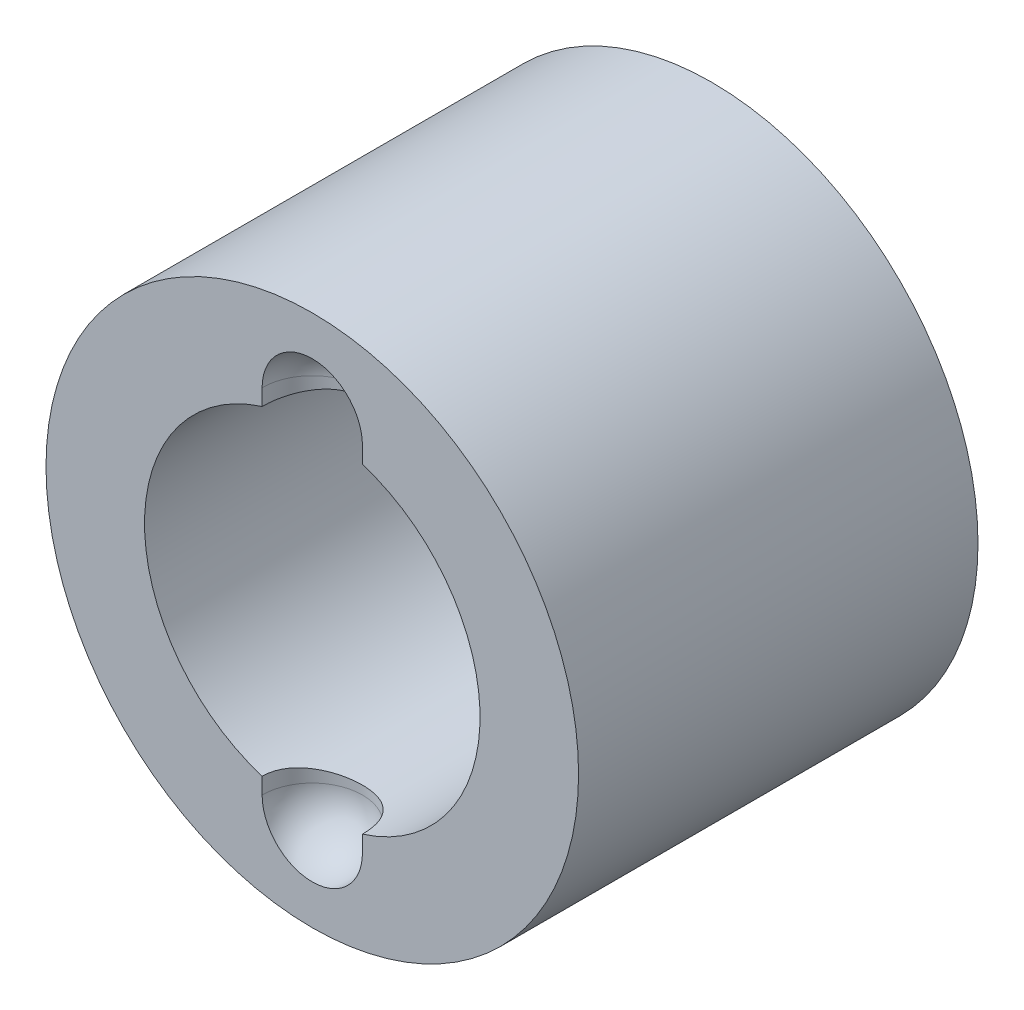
ISO-10303-21;
HEADER;
FILE_DESCRIPTION(('STEP AP214'),'2;1');
FILE_NAME('part.step','',(''),(''),'','','');
FILE_SCHEMA(('AUTOMOTIVE_DESIGN { 1 0 10303 214 1 1 1 1 }'));
ENDSEC;
DATA;
#1=APPLICATION_CONTEXT('core data for automotive mechanical design processes');
#2=APPLICATION_PROTOCOL_DEFINITION('international standard','automotive_design',2000,#1);
#3=PRODUCT_CONTEXT('',#1,'mechanical');
#4=PRODUCT('Part','Part','',(#3));
#5=PRODUCT_RELATED_PRODUCT_CATEGORY('part','',(#4));
#6=PRODUCT_DEFINITION_FORMATION('','',#4);
#7=PRODUCT_DEFINITION_CONTEXT('part definition',#1,'design');
#8=PRODUCT_DEFINITION('design','',#6,#7);
#9=PRODUCT_DEFINITION_SHAPE('','',#8);
#10=(LENGTH_UNIT() NAMED_UNIT(*) SI_UNIT(.MILLI.,.METRE.));
#11=(NAMED_UNIT(*) PLANE_ANGLE_UNIT() SI_UNIT($,.RADIAN.));
#12=(NAMED_UNIT(*) SI_UNIT($,.STERADIAN.) SOLID_ANGLE_UNIT());
#13=UNCERTAINTY_MEASURE_WITH_UNIT(LENGTH_MEASURE(1.E-05),#10,'distance_accuracy_value','');
#14=(GEOMETRIC_REPRESENTATION_CONTEXT(3) GLOBAL_UNCERTAINTY_ASSIGNED_CONTEXT((#13)) GLOBAL_UNIT_ASSIGNED_CONTEXT((#10,
#11,#12)) REPRESENTATION_CONTEXT('',''));
#15=CARTESIAN_POINT('',(0.,0.,0.));
#16=DIRECTION('',(0.,0.,1.));
#17=DIRECTION('',(1.,0.,0.));
#18=AXIS2_PLACEMENT_3D('',#15,#16,#17);
#19=CARTESIAN_POINT('',(0.,0.,19.05));
#20=DIRECTION('',(0.,0.,1.));
#21=DIRECTION('',(1.,0.,0.));
#22=AXIS2_PLACEMENT_3D('',#19,#20,#21);
#23=PLANE('',#22);
#24=CARTESIAN_POINT('',(0.,0.,19.05));
#25=DIRECTION('',(0.,0.,1.));
#26=DIRECTION('',(1.,0.,0.));
#27=AXIS2_PLACEMENT_3D('',#24,#25,#26);
#28=CIRCLE('',#27,12.7);
#29=CARTESIAN_POINT('',(-12.7,0.,19.05));
#30=VERTEX_POINT('',#29);
#31=EDGE_CURVE('E117',#30,#30,#28,.T.);
#32=ORIENTED_EDGE('',*,*,#31,.T.);
#33=EDGE_LOOP('',(#32));
#34=FACE_BOUND('',#33,.T.);
#35=CARTESIAN_POINT('',(0.,0.,19.05));
#36=DIRECTION('',(0.,0.,1.));
#37=DIRECTION('',(1.,0.,0.));
#38=AXIS2_PLACEMENT_3D('',#35,#36,#37);
#39=CIRCLE('',#38,8.001);
#40=CARTESIAN_POINT('',(-2.39273154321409,7.63484359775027,19.05));
#41=VERTEX_POINT('',#40);
#42=CARTESIAN_POINT('',(-2.39273154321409,-7.63484359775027,19.0500000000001));
#43=VERTEX_POINT('',#42);
#44=EDGE_CURVE('E113',#41,#43,#39,.T.);
#45=ORIENTED_EDGE('',*,*,#44,.F.);
#46=DIRECTION('',(0.,-1.,0.));
#47=VECTOR('',#46,1.);
#48=CARTESIAN_POINT('',(-2.39273154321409,8.41205481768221,19.0500000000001));
#49=LINE('',#48,#47);
#50=CARTESIAN_POINT('',(-2.39273154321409,8.41205481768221,19.0500000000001));
#51=VERTEX_POINT('',#50);
#52=EDGE_CURVE('E57',#51,#41,#49,.T.);
#53=ORIENTED_EDGE('',*,*,#52,.F.);
#54=CARTESIAN_POINT('',(0.000592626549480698,8.41205481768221,19.05));
#55=DIRECTION('',(0.,0.,1.));
#56=DIRECTION('',(1.,0.,0.));
#57=AXIS2_PLACEMENT_3D('',#54,#55,#56);
#58=CIRCLE('',#57,2.39332416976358);
#59=CARTESIAN_POINT('',(0.,10.8053789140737,19.05));
#60=VERTEX_POINT('',#59);
#61=EDGE_CURVE('E85',#60,#51,#58,.T.);
#62=ORIENTED_EDGE('',*,*,#61,.F.);
#63=CARTESIAN_POINT('',(-0.000592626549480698,8.41205481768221,19.05));
#64=DIRECTION('',(0.,0.,-1.));
#65=DIRECTION('',(-1.,0.,0.));
#66=AXIS2_PLACEMENT_3D('',#63,#64,#65);
#67=CIRCLE('',#66,2.39332416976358);
#68=CARTESIAN_POINT('',(2.39273154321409,8.41205481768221,19.05));
#69=VERTEX_POINT('',#68);
#70=EDGE_CURVE('E83',#60,#69,#67,.T.);
#71=ORIENTED_EDGE('',*,*,#70,.T.);
#72=DIRECTION('',(0.,-1.,0.));
#73=VECTOR('',#72,1.);
#74=CARTESIAN_POINT('',(2.39273154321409,8.41205481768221,19.05));
#75=LINE('',#74,#73);
#76=CARTESIAN_POINT('',(2.39273154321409,7.63484359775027,19.0499999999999));
#77=VERTEX_POINT('',#76);
#78=EDGE_CURVE('E90',#69,#77,#75,.T.);
#79=ORIENTED_EDGE('',*,*,#78,.T.);
#80=CARTESIAN_POINT('',(2.39273154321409,-7.63484359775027,19.05));
#81=VERTEX_POINT('',#80);
#82=EDGE_CURVE('E111',#81,#77,#39,.T.);
#83=ORIENTED_EDGE('',*,*,#82,.F.);
#84=CARTESIAN_POINT('',(2.39273154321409,-8.41205481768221,19.05));
#85=VERTEX_POINT('',#84);
#86=EDGE_CURVE('E49',#81,#85,#75,.T.);
#87=ORIENTED_EDGE('',*,*,#86,.T.);
#88=CARTESIAN_POINT('',(-0.000592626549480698,-8.41205481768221,19.05));
#89=DIRECTION('',(0.,0.,1.));
#90=DIRECTION('',(1.,0.,0.));
#91=AXIS2_PLACEMENT_3D('',#88,#89,#90);
#92=CIRCLE('',#91,2.39332416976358);
#93=CARTESIAN_POINT('',(0.,-10.8053789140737,19.05));
#94=VERTEX_POINT('',#93);
#95=EDGE_CURVE('E95',#94,#85,#92,.T.);
#96=ORIENTED_EDGE('',*,*,#95,.F.);
#97=CARTESIAN_POINT('',(0.000592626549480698,-8.41205481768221,19.05));
#98=DIRECTION('',(0.,0.,-1.));
#99=DIRECTION('',(-1.,0.,0.));
#100=AXIS2_PLACEMENT_3D('',#97,#98,#99);
#101=CIRCLE('',#100,2.39332416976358);
#102=CARTESIAN_POINT('',(-2.39273154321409,-8.41205481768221,19.0500000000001));
#103=VERTEX_POINT('',#102);
#104=EDGE_CURVE('E105',#94,#103,#101,.T.);
#105=ORIENTED_EDGE('',*,*,#104,.T.);
#106=EDGE_CURVE('E103',#43,#103,#49,.T.);
#107=ORIENTED_EDGE('',*,*,#106,.F.);
#108=EDGE_LOOP('',(#45,#53,#62,#71,#79,#83,#87,#96,#105,#107));
#109=FACE_BOUND('',#108,.T.);
#110=ADVANCED_FACE('F29',(#34,#109),#23,.T.);
#111=CARTESIAN_POINT('',(0.,0.,19.05));
#112=DIRECTION('',(0.,0.,-1.));
#113=DIRECTION('',(-1.,0.,0.));
#114=AXIS2_PLACEMENT_3D('',#111,#112,#113);
#115=CYLINDRICAL_SURFACE('',#114,8.001);
#116=CARTESIAN_POINT('',(0.,0.,0.));
#117=DIRECTION('',(0.,0.,1.));
#118=DIRECTION('',(1.,0.,0.));
#119=AXIS2_PLACEMENT_3D('',#116,#117,#118);
#120=CIRCLE('',#119,8.001);
#121=CARTESIAN_POINT('',(8.001,0.,0.));
#122=VERTEX_POINT('',#121);
#123=EDGE_CURVE('E86',#122,#122,#120,.T.);
#124=ORIENTED_EDGE('',*,*,#123,.F.);
#125=EDGE_LOOP('',(#124));
#126=FACE_BOUND('',#125,.T.);
#127=ORIENTED_EDGE('',*,*,#82,.T.);
#128=CARTESIAN_POINT('',(2.39273154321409,7.63484359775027,19.05));
#129=CARTESIAN_POINT('',(2.39273973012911,7.6348344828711,18.9843206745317));
#130=CARTESIAN_POINT('',(2.3900273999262,7.63569090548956,18.9186465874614));
#131=CARTESIAN_POINT('',(2.37922539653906,7.63906708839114,18.7877994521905));
#132=CARTESIAN_POINT('',(2.37113692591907,7.6415864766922,18.7226262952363));
#133=CARTESIAN_POINT('',(2.3496733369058,7.64821255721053,18.593404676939));
#134=CARTESIAN_POINT('',(2.33631158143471,7.65231523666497,18.5293537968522));
#135=CARTESIAN_POINT('',(2.30443249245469,7.66197542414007,18.4026772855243));
#136=CARTESIAN_POINT('',(2.28591502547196,7.66753296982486,18.3400516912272));
#137=CARTESIAN_POINT('',(2.22285582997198,7.68614716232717,18.1550052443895));
#138=CARTESIAN_POINT('',(2.17077984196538,7.70115438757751,18.0352511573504));
#139=CARTESIAN_POINT('',(2.04816829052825,7.73466371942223,17.8061799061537));
#140=CARTESIAN_POINT('',(1.97762421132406,7.75316743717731,17.6968675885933));
#141=CARTESIAN_POINT('',(1.81770565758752,7.79223315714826,17.4883183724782));
#142=CARTESIAN_POINT('',(1.72785466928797,7.81283859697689,17.3894542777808));
#143=CARTESIAN_POINT('',(1.53289349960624,7.8534157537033,17.2079497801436));
#144=CARTESIAN_POINT('',(1.42778074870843,7.87338736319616,17.1253121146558));
#145=CARTESIAN_POINT('',(1.20261061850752,7.91094188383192,16.976975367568));
#146=CARTESIAN_POINT('',(1.08229064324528,7.92846731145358,16.9116590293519));
#147=CARTESIAN_POINT('',(0.8317667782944,7.95864659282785,16.8023358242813));
#148=CARTESIAN_POINT('',(0.701565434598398,7.97130169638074,16.7583234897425));
#149=CARTESIAN_POINT('',(0.438898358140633,7.99000655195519,16.6940949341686));
#150=CARTESIAN_POINT('',(0.306602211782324,7.99623384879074,16.6732378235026));
#151=CARTESIAN_POINT('',(0.0402488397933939,8.00200662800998,16.6538855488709));
#152=CARTESIAN_POINT('',(-0.0938080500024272,8.00155336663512,16.6553861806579));
#153=CARTESIAN_POINT('',(-0.355377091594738,7.99414146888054,16.6802768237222));
#154=CARTESIAN_POINT('',(-0.482962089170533,7.98738920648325,16.7029724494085));
#155=CARTESIAN_POINT('',(-0.73242044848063,7.96838872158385,16.7684746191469));
#156=CARTESIAN_POINT('',(-0.85429351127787,7.95614021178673,16.8112822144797));
#157=CARTESIAN_POINT('',(-1.09052538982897,7.92723744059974,16.9162655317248));
#158=CARTESIAN_POINT('',(-1.20478050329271,7.91053366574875,16.978660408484));
#159=CARTESIAN_POINT('',(-1.4214197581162,7.8744932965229,17.1208734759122));
#160=CARTESIAN_POINT('',(-1.52380124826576,7.85515611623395,17.2006955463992));
#161=CARTESIAN_POINT('',(-1.7179231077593,7.81504623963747,17.3790907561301));
#162=CARTESIAN_POINT('',(-1.80910716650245,7.7942469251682,17.478263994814));
#163=CARTESIAN_POINT('',(-1.97372470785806,7.75419952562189,17.690722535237));
#164=CARTESIAN_POINT('',(-2.04715302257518,7.73495189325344,17.8040119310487));
#165=CARTESIAN_POINT('',(-2.17475949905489,7.70005570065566,18.0429648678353));
#166=CARTESIAN_POINT('',(-2.22873802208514,7.68444501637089,18.1687407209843));
#167=CARTESIAN_POINT('',(-2.31451883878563,7.65904940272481,18.4281045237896));
#168=CARTESIAN_POINT('',(-2.3463550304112,7.64925557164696,18.5616801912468));
#169=CARTESIAN_POINT('',(-2.37526724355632,7.64029910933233,18.7554187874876));
#170=CARTESIAN_POINT('',(-2.38181561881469,7.63825778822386,18.8141686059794));
#171=CARTESIAN_POINT('',(-2.39054384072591,7.63552986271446,18.9319356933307));
#172=CARTESIAN_POINT('',(-2.39273012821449,7.6348412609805,18.9909524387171));
#173=CARTESIAN_POINT('',(-2.39273154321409,7.63484359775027,19.05));
#174=B_SPLINE_CURVE_WITH_KNOTS('',3,(#128,#129,#130,#131,#132,#133,#134,#135,#136,#137,#138,
#139,#140,#141,#142,#143,#144,#145,#146,#147,#148,#149,#150,#151,#152,#153,#154,#155,#156,#157,
#158,#159,#160,#161,#162,#163,#164,#165,#166,#167,#168,#169,#170,#171,#172,#173),.UNSPECIFIED.,
.F.,.F.,(4,2,2,2,2,2,2,2,2,2,2,2,2,2,2,2,2,2,2,2,2,2,4),(0.,0.196967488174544,0.393890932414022,
0.590318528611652,0.78675121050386,1.17912452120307,1.57167907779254,1.97534588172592,
2.37908072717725,2.79110750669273,3.20302848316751,3.60323971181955,4.00337568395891,
4.39084583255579,4.77833623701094,5.17032669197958,5.56240450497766,5.96946862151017,
6.37665107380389,6.7879013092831,7.19852056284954,7.37581988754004,7.5528572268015),.UNSPECIFIED.);
#175=EDGE_CURVE('E11',#77,#41,#174,.T.);
#176=ORIENTED_EDGE('',*,*,#175,.T.);
#177=ORIENTED_EDGE('',*,*,#44,.T.);
#178=CARTESIAN_POINT('',(-2.39273154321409,-7.63484359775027,19.05));
#179=CARTESIAN_POINT('',(-2.39273973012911,-7.6348344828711,18.9843206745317));
#180=CARTESIAN_POINT('',(-2.3900273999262,-7.63569090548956,18.9186465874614));
#181=CARTESIAN_POINT('',(-2.37922539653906,-7.63906708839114,18.7877994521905));
#182=CARTESIAN_POINT('',(-2.37113692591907,-7.6415864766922,18.7226262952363));
#183=CARTESIAN_POINT('',(-2.3496733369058,-7.64821255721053,18.593404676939));
#184=CARTESIAN_POINT('',(-2.33631158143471,-7.65231523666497,18.5293537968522));
#185=CARTESIAN_POINT('',(-2.30443249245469,-7.66197542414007,18.4026772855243));
#186=CARTESIAN_POINT('',(-2.28591502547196,-7.66753296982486,18.3400516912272));
#187=CARTESIAN_POINT('',(-2.22285582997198,-7.68614716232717,18.1550052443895));
#188=CARTESIAN_POINT('',(-2.17077984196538,-7.70115438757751,18.0352511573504));
#189=CARTESIAN_POINT('',(-2.04816829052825,-7.73466371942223,17.8061799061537));
#190=CARTESIAN_POINT('',(-1.97762421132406,-7.75316743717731,17.6968675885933));
#191=CARTESIAN_POINT('',(-1.81770565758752,-7.79223315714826,17.4883183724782));
#192=CARTESIAN_POINT('',(-1.72785466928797,-7.81283859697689,17.3894542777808));
#193=CARTESIAN_POINT('',(-1.53289349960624,-7.8534157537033,17.2079497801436));
#194=CARTESIAN_POINT('',(-1.42778074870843,-7.87338736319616,17.1253121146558));
#195=CARTESIAN_POINT('',(-1.20261061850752,-7.91094188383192,16.976975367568));
#196=CARTESIAN_POINT('',(-1.08229064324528,-7.92846731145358,16.9116590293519));
#197=CARTESIAN_POINT('',(-0.8317667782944,-7.95864659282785,16.8023358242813));
#198=CARTESIAN_POINT('',(-0.701565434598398,-7.97130169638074,16.7583234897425));
#199=CARTESIAN_POINT('',(-0.438898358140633,-7.99000655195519,16.6940949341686));
#200=CARTESIAN_POINT('',(-0.306602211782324,-7.99623384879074,16.6732378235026));
#201=CARTESIAN_POINT('',(-0.0402488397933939,-8.00200662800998,16.6538855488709));
#202=CARTESIAN_POINT('',(0.0938080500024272,-8.00155336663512,16.6553861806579));
#203=CARTESIAN_POINT('',(0.355377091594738,-7.99414146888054,16.6802768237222));
#204=CARTESIAN_POINT('',(0.482962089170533,-7.98738920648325,16.7029724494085));
#205=CARTESIAN_POINT('',(0.73242044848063,-7.96838872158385,16.7684746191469));
#206=CARTESIAN_POINT('',(0.85429351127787,-7.95614021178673,16.8112822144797));
#207=CARTESIAN_POINT('',(1.09052538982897,-7.92723744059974,16.9162655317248));
#208=CARTESIAN_POINT('',(1.20478050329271,-7.91053366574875,16.978660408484));
#209=CARTESIAN_POINT('',(1.4214197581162,-7.8744932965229,17.1208734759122));
#210=CARTESIAN_POINT('',(1.52380124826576,-7.85515611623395,17.2006955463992));
#211=CARTESIAN_POINT('',(1.7179231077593,-7.81504623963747,17.3790907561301));
#212=CARTESIAN_POINT('',(1.80910716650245,-7.7942469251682,17.478263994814));
#213=CARTESIAN_POINT('',(1.97372470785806,-7.75419952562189,17.690722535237));
#214=CARTESIAN_POINT('',(2.04715302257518,-7.73495189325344,17.8040119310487));
#215=CARTESIAN_POINT('',(2.17475949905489,-7.70005570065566,18.0429648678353));
#216=CARTESIAN_POINT('',(2.22873802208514,-7.68444501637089,18.1687407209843));
#217=CARTESIAN_POINT('',(2.31451883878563,-7.65904940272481,18.4281045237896));
#218=CARTESIAN_POINT('',(2.3463550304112,-7.64925557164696,18.5616801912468));
#219=CARTESIAN_POINT('',(2.37526724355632,-7.64029910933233,18.7554187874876));
#220=CARTESIAN_POINT('',(2.38181561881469,-7.63825778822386,18.8141686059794));
#221=CARTESIAN_POINT('',(2.39054384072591,-7.63552986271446,18.9319356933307));
#222=CARTESIAN_POINT('',(2.39273012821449,-7.6348412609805,18.9909524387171));
#223=CARTESIAN_POINT('',(2.39273154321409,-7.63484359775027,19.05));
#224=B_SPLINE_CURVE_WITH_KNOTS('',3,(#178,#179,#180,#181,#182,#183,#184,#185,#186,#187,#188,
#189,#190,#191,#192,#193,#194,#195,#196,#197,#198,#199,#200,#201,#202,#203,#204,#205,#206,#207,
#208,#209,#210,#211,#212,#213,#214,#215,#216,#217,#218,#219,#220,#221,#222,#223),.UNSPECIFIED.,
.F.,.F.,(4,2,2,2,2,2,2,2,2,2,2,2,2,2,2,2,2,2,2,2,2,2,4),(0.,0.196967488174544,0.393890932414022,
0.590318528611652,0.78675121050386,1.17912452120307,1.57167907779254,1.97534588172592,
2.37908072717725,2.79110750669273,3.20302848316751,3.60323971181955,4.00337568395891,
4.39084583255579,4.77833623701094,5.17032669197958,5.56240450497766,5.96946862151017,
6.37665107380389,6.7879013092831,7.19852056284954,7.37581988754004,7.5528572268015),.UNSPECIFIED.);
#225=EDGE_CURVE('E42',#43,#81,#224,.T.);
#226=ORIENTED_EDGE('',*,*,#225,.T.);
#227=EDGE_LOOP('',(#127,#176,#177,#226));
#228=FACE_BOUND('',#227,.T.);
#229=ADVANCED_FACE('F122',(#126,#228),#115,.F.);
#230=CARTESIAN_POINT('',(0.,0.,0.));
#231=DIRECTION('',(0.,0.,1.));
#232=DIRECTION('',(1.,0.,0.));
#233=AXIS2_PLACEMENT_3D('',#230,#231,#232);
#234=PLANE('',#233);
#235=CARTESIAN_POINT('',(0.,0.,0.));
#236=DIRECTION('',(0.,0.,1.));
#237=DIRECTION('',(1.,0.,0.));
#238=AXIS2_PLACEMENT_3D('',#235,#236,#237);
#239=CIRCLE('',#238,12.7);
#240=CARTESIAN_POINT('',(-12.7,0.,0.));
#241=VERTEX_POINT('',#240);
#242=EDGE_CURVE('E114',#241,#241,#239,.T.);
#243=ORIENTED_EDGE('',*,*,#242,.F.);
#244=EDGE_LOOP('',(#243));
#245=FACE_BOUND('',#244,.T.);
#246=ORIENTED_EDGE('',*,*,#123,.T.);
#247=EDGE_LOOP('',(#246));
#248=FACE_BOUND('',#247,.T.);
#249=ADVANCED_FACE('F143',(#245,#248),#234,.F.);
#250=CARTESIAN_POINT('',(0.,0.,19.05));
#251=DIRECTION('',(0.,0.,-1.));
#252=DIRECTION('',(-1.,0.,0.));
#253=AXIS2_PLACEMENT_3D('',#250,#251,#252);
#254=CYLINDRICAL_SURFACE('',#253,12.7);
#255=CARTESIAN_POINT('',(-12.7,0.,19.05));
#256=CARTESIAN_POINT('',(-12.7,0.,18.8515625));
#257=CARTESIAN_POINT('',(-12.7,0.,18.653125));
#258=CARTESIAN_POINT('',(-12.7,0.,18.25625));
#259=CARTESIAN_POINT('',(-12.7,0.,18.0578125));
#260=CARTESIAN_POINT('',(-12.7,0.,17.6609375));
#261=CARTESIAN_POINT('',(-12.7,0.,17.4625));
#262=CARTESIAN_POINT('',(-12.7,0.,17.065625));
#263=CARTESIAN_POINT('',(-12.7,0.,16.8671875));
#264=CARTESIAN_POINT('',(-12.7,0.,16.4703125));
#265=CARTESIAN_POINT('',(-12.7,0.,16.271875));
#266=CARTESIAN_POINT('',(-12.7,0.,15.875));
#267=CARTESIAN_POINT('',(-12.7,0.,15.6765625));
#268=CARTESIAN_POINT('',(-12.7,0.,15.2796875));
#269=CARTESIAN_POINT('',(-12.7,0.,15.08125));
#270=CARTESIAN_POINT('',(-12.7,0.,14.684375));
#271=CARTESIAN_POINT('',(-12.7,0.,14.4859375));
#272=CARTESIAN_POINT('',(-12.7,0.,14.0890625));
#273=CARTESIAN_POINT('',(-12.7,0.,13.890625));
#274=CARTESIAN_POINT('',(-12.7,0.,13.49375));
#275=CARTESIAN_POINT('',(-12.7,0.,13.2953125));
#276=CARTESIAN_POINT('',(-12.7,0.,12.8984375));
#277=CARTESIAN_POINT('',(-12.7,0.,12.7));
#278=CARTESIAN_POINT('',(-12.7,0.,12.303125));
#279=CARTESIAN_POINT('',(-12.7,0.,12.1046875));
#280=CARTESIAN_POINT('',(-12.7,0.,11.7078125));
#281=CARTESIAN_POINT('',(-12.7,0.,11.509375));
#282=CARTESIAN_POINT('',(-12.7,0.,11.1125));
#283=CARTESIAN_POINT('',(-12.7,0.,10.9140625));
#284=CARTESIAN_POINT('',(-12.7,0.,10.5171875));
#285=CARTESIAN_POINT('',(-12.7,0.,10.31875));
#286=CARTESIAN_POINT('',(-12.7,0.,9.921875));
#287=CARTESIAN_POINT('',(-12.7,0.,9.7234375));
#288=CARTESIAN_POINT('',(-12.7,0.,9.3265625));
#289=CARTESIAN_POINT('',(-12.7,0.,9.128125));
#290=CARTESIAN_POINT('',(-12.7,0.,8.73125));
#291=CARTESIAN_POINT('',(-12.7,0.,8.5328125));
#292=CARTESIAN_POINT('',(-12.7,0.,8.1359375));
#293=CARTESIAN_POINT('',(-12.7,0.,7.9375));
#294=CARTESIAN_POINT('',(-12.7,0.,7.540625));
#295=CARTESIAN_POINT('',(-12.7,0.,7.3421875));
#296=CARTESIAN_POINT('',(-12.7,0.,6.9453125));
#297=CARTESIAN_POINT('',(-12.7,0.,6.746875));
#298=CARTESIAN_POINT('',(-12.7,0.,6.35));
#299=CARTESIAN_POINT('',(-12.7,0.,6.1515625));
#300=CARTESIAN_POINT('',(-12.7,0.,5.7546875));
#301=CARTESIAN_POINT('',(-12.7,0.,5.55625));
#302=CARTESIAN_POINT('',(-12.7,0.,5.159375));
#303=CARTESIAN_POINT('',(-12.7,0.,4.9609375));
#304=CARTESIAN_POINT('',(-12.7,0.,4.5640625));
#305=CARTESIAN_POINT('',(-12.7,0.,4.365625));
#306=CARTESIAN_POINT('',(-12.7,0.,3.96875));
#307=CARTESIAN_POINT('',(-12.7,0.,3.7703125));
#308=CARTESIAN_POINT('',(-12.7,0.,3.3734375));
#309=CARTESIAN_POINT('',(-12.7,0.,3.175));
#310=CARTESIAN_POINT('',(-12.7,0.,2.778125));
#311=CARTESIAN_POINT('',(-12.7,0.,2.5796875));
#312=CARTESIAN_POINT('',(-12.7,0.,2.1828125));
#313=CARTESIAN_POINT('',(-12.7,0.,1.984375));
#314=CARTESIAN_POINT('',(-12.7,0.,1.5875));
#315=CARTESIAN_POINT('',(-12.7,0.,1.3890625));
#316=CARTESIAN_POINT('',(-12.7,0.,0.992187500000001));
#317=CARTESIAN_POINT('',(-12.7,0.,0.793750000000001));
#318=CARTESIAN_POINT('',(-12.7,0.,0.396875));
#319=CARTESIAN_POINT('',(-12.7,0.,0.1984375));
#320=CARTESIAN_POINT('',(-12.7,0.,0.));
#321=B_SPLINE_CURVE_WITH_KNOTS('',3,(#255,#256,#257,#258,#259,#260,#261,#262,#263,#264,#265,
#266,#267,#268,#269,#270,#271,#272,#273,#274,#275,#276,#277,#278,#279,#280,#281,#282,#283,#284,
#285,#286,#287,#288,#289,#290,#291,#292,#293,#294,#295,#296,#297,#298,#299,#300,#301,#302,#303,
#304,#305,#306,#307,#308,#309,#310,#311,#312,#313,#314,#315,#316,#317,#318,#319,#320),
.UNSPECIFIED.,.F.,.F.,(4,2,2,2,2,2,2,2,2,2,2,2,2,2,2,2,2,2,2,2,2,2,2,2,2,2,2,2,2,2,2,2,4),(0.,
0.595312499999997,1.190625,1.7859375,2.38125,2.9765625,3.571875,4.1671875,4.7625,5.3578125,
5.953125,6.5484375,7.14375,7.7390625,8.334375,8.9296875,9.525,10.1203125,10.715625,11.3109375,
11.90625,12.5015625,13.096875,13.6921875,14.2875,14.8828125,15.478125,16.0734375,16.66875,
17.2640625,17.859375,18.4546875,19.05),.UNSPECIFIED.);
#322=EDGE_CURVE('BSEAM31',#30,#241,#321,.T.);
#323=ORIENTED_EDGE('',*,*,#31,.F.);
#324=ORIENTED_EDGE('',*,*,#242,.T.);
#325=ORIENTED_EDGE('',*,*,#322,.T.);
#326=ORIENTED_EDGE('',*,*,#322,.F.);
#327=EDGE_LOOP('',(#323,#325,#324,#326));
#328=FACE_BOUND('',#327,.T.);
#329=ADVANCED_FACE('F31',(#328),#254,.T.);
#330=CARTESIAN_POINT('',(0.,0.,19.05));
#331=DIRECTION('',(0.,-1.,0.));
#332=DIRECTION('',(0.,0.,-1.));
#333=AXIS2_PLACEMENT_3D('',#330,#331,#332);
#334=CYLINDRICAL_SURFACE('',#333,2.39273154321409);
#335=ORIENTED_EDGE('',*,*,#106,.T.);
#336=CARTESIAN_POINT('',(0.,-8.41205481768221,19.05));
#337=DIRECTION('',(0.,-1.,0.));
#338=DIRECTION('',(0.,0.,-1.));
#339=AXIS2_PLACEMENT_3D('',#336,#337,#338);
#340=CIRCLE('',#339,2.39273154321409);
#341=EDGE_CURVE('E87',#103,#85,#340,.T.);
#342=ORIENTED_EDGE('',*,*,#341,.T.);
#343=ORIENTED_EDGE('',*,*,#86,.F.);
#344=ORIENTED_EDGE('',*,*,#225,.F.);
#345=EDGE_LOOP('',(#335,#342,#343,#344));
#346=FACE_BOUND('',#345,.T.);
#347=ADVANCED_FACE('F125',(#346),#334,.F.);
#348=CARTESIAN_POINT('',(0.,-8.41205481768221,19.0505926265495));
#349=DIRECTION('',(-1.,0.,0.));
#350=DIRECTION('',(0.,0.,-1.));
#351=AXIS2_PLACEMENT_3D('',#348,#349,#350);
#352=CIRCLE('',#351,2.39332416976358);
#353=TRIMMED_CURVE('',#352,(PARAMETER_VALUE(-1.57054871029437)),
(PARAMETER_VALUE(1.57054871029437)),.T.,.PARAMETER.);
#354=CARTESIAN_POINT('',(0.,-8.41205481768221,19.05));
#355=DIRECTION('',(0.,-1.,0.));
#356=AXIS1_PLACEMENT('',#354,#355);
#357=SURFACE_OF_REVOLUTION('',#353,#356);
#358=ORIENTED_EDGE('',*,*,#95,.T.);
#359=ORIENTED_EDGE('',*,*,#341,.F.);
#360=ORIENTED_EDGE('',*,*,#104,.F.);
#361=EDGE_LOOP('',(#358,#359,#360));
#362=FACE_BOUND('',#361,.T.);
#363=ADVANCED_FACE('F129',(#362),#357,.F.);
#364=ORIENTED_EDGE('',*,*,#78,.F.);
#365=CARTESIAN_POINT('',(0.,8.41205481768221,19.05));
#366=DIRECTION('',(0.,-1.,0.));
#367=DIRECTION('',(0.,0.,-1.));
#368=AXIS2_PLACEMENT_3D('',#365,#366,#367);
#369=CIRCLE('',#368,2.39273154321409);
#370=EDGE_CURVE('E79',#51,#69,#369,.T.);
#371=ORIENTED_EDGE('',*,*,#370,.F.);
#372=ORIENTED_EDGE('',*,*,#52,.T.);
#373=ORIENTED_EDGE('',*,*,#175,.F.);
#374=EDGE_LOOP('',(#364,#371,#372,#373));
#375=FACE_BOUND('',#374,.T.);
#376=ADVANCED_FACE('F91',(#375),#334,.F.);
#377=CARTESIAN_POINT('',(0.,8.41205481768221,19.0505926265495));
#378=DIRECTION('',(-1.,0.,0.));
#379=DIRECTION('',(0.,0.,-1.));
#380=AXIS2_PLACEMENT_3D('',#377,#378,#379);
#381=CIRCLE('',#380,2.39332416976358);
#382=TRIMMED_CURVE('',#381,(PARAMETER_VALUE(-1.57054871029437)),
(PARAMETER_VALUE(1.57054871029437)),.T.,.PARAMETER.);
#383=CARTESIAN_POINT('',(0.,8.41205481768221,19.05));
#384=DIRECTION('',(0.,-1.,0.));
#385=AXIS1_PLACEMENT('',#383,#384);
#386=SURFACE_OF_REVOLUTION('',#382,#385);
#387=ORIENTED_EDGE('',*,*,#370,.T.);
#388=ORIENTED_EDGE('',*,*,#70,.F.);
#389=ORIENTED_EDGE('',*,*,#61,.T.);
#390=EDGE_LOOP('',(#387,#388,#389));
#391=FACE_BOUND('',#390,.T.);
#392=ADVANCED_FACE('F81',(#391),#386,.F.);
#393=CLOSED_SHELL('',(#110,#229,#249,#329,#347,#363,#376,#392));
#394=MANIFOLD_SOLID_BREP('B2',#393);
#395=ADVANCED_BREP_SHAPE_REPRESENTATION('',(#18,#394),#14);
#396=SHAPE_DEFINITION_REPRESENTATION(#9,#395);
ENDSEC;
END-ISO-10303-21;
